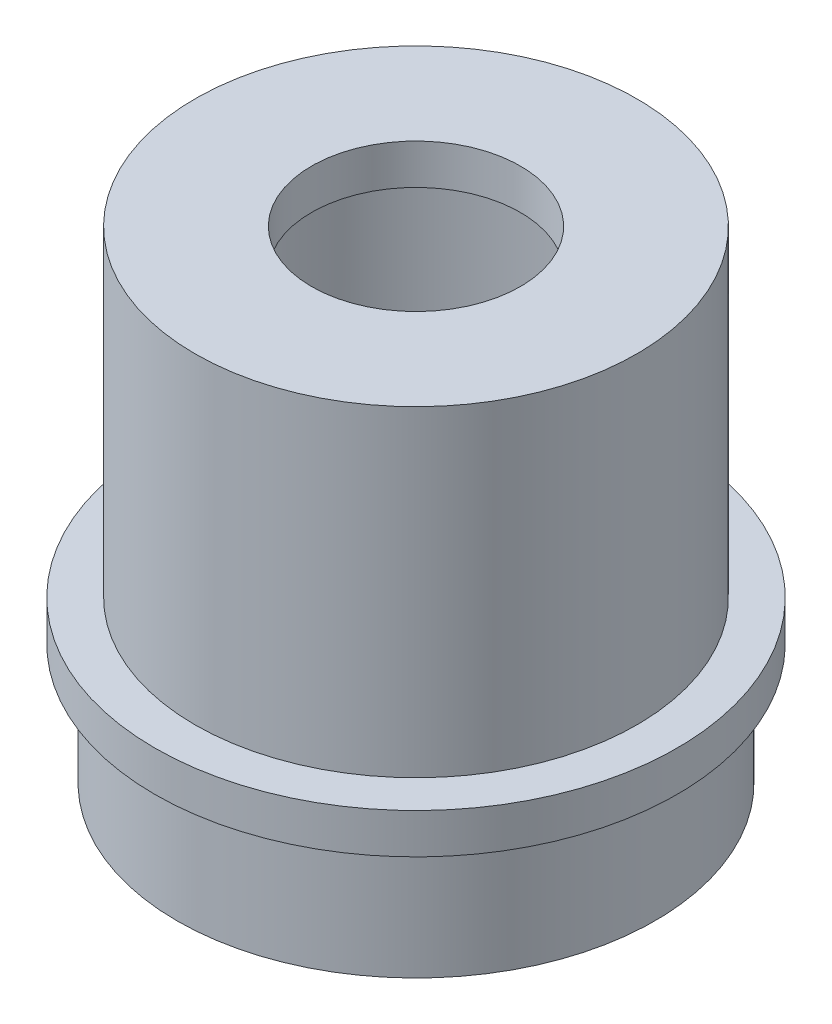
from build123d import *

# Parameters (mm, degrees)
CROQUIS1_R               = 5.5
SALIENTE_EXTRUIR1_DEPTH  = 1
CROQUIS2_R               = 5.5
CROQUIS2_R_2             = 5
SALIENTE_EXTRUIR4_DEPTH  = 2
CROQUIS3_R               = 5
CORTAR_EXTRUIR1_DEPTH    = 2
CROQUIS4_R               = 6
SALIENTE_EXTRUIR7_DEPTH  = 1
CROQUIS7_R               = 5
CORTAR_EXTRUIR3_DEPTH    = 1
CROQUIS8_R               = 5.5
CROQUIS8_R_2             = 5
SALIENTE_EXTRUIR8_DEPTH  = 8
CROQUIS9_R               = 5
SALIENTE_EXTRUIR9_DEPTH  = 1
CROQUIS10_R              = 2.6
CORTAR_EXTRUIR4_DEPTH    = 1
CROQUIS11_R              = 5.85
SALIENTE_EXTRUIR10_DEPTH = 3
CROQUIS12_R              = 6.5
CROQUIS12_R_2            = 6
SALIENTE_EXTRUIR11_DEPTH = 1
CROQUIS13_R              = 5.975
SALIENTE_EXTRUIR12_DEPTH = 3
CROQUIS14_R              = 5.975
CROQUIS14_R_2            = 5.95
CORTAR_EXTRUIR5_DEPTH    = 3


with BuildPart() as part:
    # Croquis1 → Saliente-Extruir1 (new body)
    with BuildSketch(Plane(origin=(0, 0, 0), x_dir=(1, 0, 0), z_dir=(0, 1, 0))):
        with Locations(Location((0, 0, 0), (0, 0, 270))):
            Circle(CROQUIS1_R)
    extrude(amount=SALIENTE_EXTRUIR1_DEPTH)

    # Croquis2 → Saliente-Extruir4 (add)
    # profile 1 of 2: a face of its own
    with BuildSketch(Plane(origin=(0, 1, 0), x_dir=(1, 0, 0), z_dir=(0, 1, 0))):
        with Locations(Location((0, 0, 0), (0, 0, 270))):
            Circle(CROQUIS2_R)
        Circle(CROQUIS2_R_2, mode=Mode.SUBTRACT)
    # profile 2 of 2: a face of its own
    with BuildSketch(Plane(origin=(0, 1, 0), x_dir=(1, 0, 0), z_dir=(0, 1, 0))):
        with Locations(Location((0, 0, 0), (0, 0, 270))):
            Circle(CROQUIS2_R)
    extrude(amount=SALIENTE_EXTRUIR4_DEPTH)

    # Croquis3 → Cortar-Extruir1 (cut)
    with BuildSketch(Plane(origin=(0, 3, 0), x_dir=(1, 0, 0), z_dir=(0, 1, 0))):
        with Locations(Location((0, 0, 0), (0, 0, 270))):
            Circle(CROQUIS3_R)
    extrude(amount=-CORTAR_EXTRUIR1_DEPTH, mode=Mode.SUBTRACT)

    # Croquis4 → Saliente-Extruir7 (add)
    with BuildSketch(Plane(origin=(0, 3, 0), x_dir=(1, 0, 0), z_dir=(0, 1, 0))):
        with Locations(Location((0, 0, 0), (0, 0, 270))):
            Circle(CROQUIS4_R)
    extrude(amount=SALIENTE_EXTRUIR7_DEPTH)

    # Croquis7 → Cortar-Extruir3 (cut)
    with BuildSketch(Plane(origin=(0, 4, 0), x_dir=(1, 0, 0), z_dir=(0, 1, 0))):
        with Locations(Location((0, 0, 0), (0, 0, 270))):
            Circle(CROQUIS7_R)
    extrude(amount=-CORTAR_EXTRUIR3_DEPTH, mode=Mode.SUBTRACT)

    # Croquis8 → Saliente-Extruir8 (add)
    with BuildSketch(Plane(origin=(0, 4, 0), x_dir=(1, 0, 0), z_dir=(0, 1, 0))):
        with Locations(Location((0, 0, 0), (0, 0, 270))):
            Circle(CROQUIS8_R)
        with Locations(Location((0, 0, 0), (0, 0, 270))):
            Circle(CROQUIS8_R_2, mode=Mode.SUBTRACT)
    extrude(amount=SALIENTE_EXTRUIR8_DEPTH)

    # Croquis9 → Saliente-Extruir9 (add)
    with BuildSketch(Plane(origin=(0, 12, 0), x_dir=(1, 0, 0), z_dir=(0, 1, 0))):
        with Locations(Location((0, 0, 0), (0, 0, 270))):
            Circle(CROQUIS9_R)
    extrude(amount=-SALIENTE_EXTRUIR9_DEPTH)

    # Croquis10 → Cortar-Extruir4 (cut)
    with BuildSketch(Plane(origin=(0, 12, 0), x_dir=(1, 0, 0), z_dir=(0, 1, 0))):
        with Locations(Location((0, 0, 0), (0, 0, 270))):
            Circle(CROQUIS10_R)
    extrude(amount=-CORTAR_EXTRUIR4_DEPTH, mode=Mode.SUBTRACT)

    # Croquis11 → Saliente-Extruir10 (add)
    with BuildSketch(Plane.XZ):
        with Locations(Location((0, 0, 0), (0, 0, 270))):
            Circle(CROQUIS11_R)
    extrude(amount=-SALIENTE_EXTRUIR10_DEPTH)

    # Croquis12 → Saliente-Extruir11 (add)
    with BuildSketch(Plane.XZ.offset(-3)):
        with Locations(Location((0, 0, 0), (0, 0, 270))):
            Circle(CROQUIS12_R)
        Circle(CROQUIS12_R_2, mode=Mode.SUBTRACT)
    extrude(amount=-SALIENTE_EXTRUIR11_DEPTH)

    # Croquis13 → Saliente-Extruir12 (add)
    with BuildSketch(Plane.XZ):
        with Locations(Location((0, 0, 0), (0, 0, 270))):
            Circle(CROQUIS13_R)
    extrude(amount=-SALIENTE_EXTRUIR12_DEPTH)

    # Croquis14 → Cortar-Extruir5 (cut)
    with BuildSketch(Plane.XZ):
        Circle(CROQUIS14_R)
        with Locations(Location((0, 0, 0), (0, 0, 270))):
            Circle(CROQUIS14_R_2, mode=Mode.SUBTRACT)
    extrude(amount=-CORTAR_EXTRUIR5_DEPTH, mode=Mode.SUBTRACT)


solid = part.part
